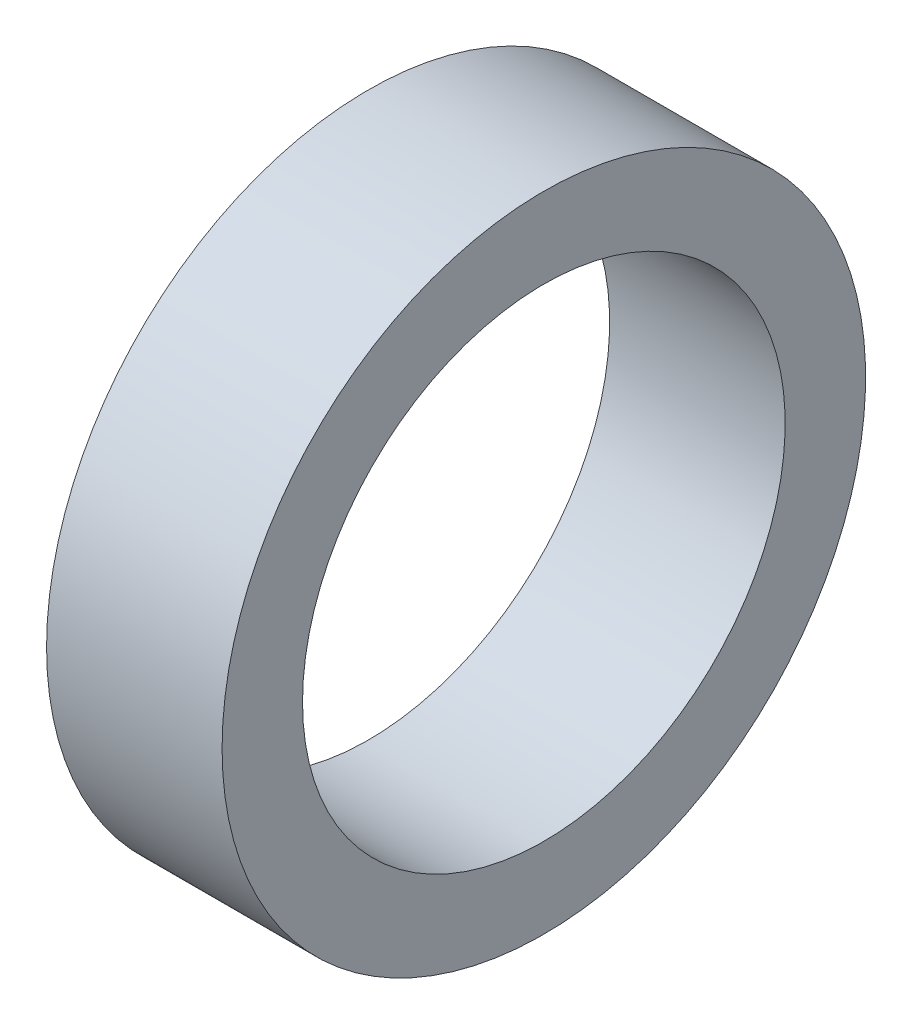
ISO-10303-21;
HEADER;
FILE_DESCRIPTION(('STEP AP214'),'2;1');
FILE_NAME('part.step','',(''),(''),'','','');
FILE_SCHEMA(('AUTOMOTIVE_DESIGN { 1 0 10303 214 1 1 1 1 }'));
ENDSEC;
DATA;
#1=APPLICATION_CONTEXT('core data for automotive mechanical design processes');
#2=APPLICATION_PROTOCOL_DEFINITION('international standard','automotive_design',2000,#1);
#3=PRODUCT_CONTEXT('',#1,'mechanical');
#4=PRODUCT('Part','Part','',(#3));
#5=PRODUCT_RELATED_PRODUCT_CATEGORY('part','',(#4));
#6=PRODUCT_DEFINITION_FORMATION('','',#4);
#7=PRODUCT_DEFINITION_CONTEXT('part definition',#1,'design');
#8=PRODUCT_DEFINITION('design','',#6,#7);
#9=PRODUCT_DEFINITION_SHAPE('','',#8);
#10=(LENGTH_UNIT() NAMED_UNIT(*) SI_UNIT(.MILLI.,.METRE.));
#11=(NAMED_UNIT(*) PLANE_ANGLE_UNIT() SI_UNIT($,.RADIAN.));
#12=(NAMED_UNIT(*) SI_UNIT($,.STERADIAN.) SOLID_ANGLE_UNIT());
#13=UNCERTAINTY_MEASURE_WITH_UNIT(LENGTH_MEASURE(1.E-05),#10,'distance_accuracy_value','');
#14=(GEOMETRIC_REPRESENTATION_CONTEXT(3) GLOBAL_UNCERTAINTY_ASSIGNED_CONTEXT((#13)) GLOBAL_UNIT_ASSIGNED_CONTEXT((#10,
#11,#12)) REPRESENTATION_CONTEXT('',''));
#15=CARTESIAN_POINT('',(0.,0.,0.));
#16=DIRECTION('',(0.,0.,1.));
#17=DIRECTION('',(1.,0.,0.));
#18=AXIS2_PLACEMENT_3D('',#15,#16,#17);
#19=CARTESIAN_POINT('',(-5.25971707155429,0.,0.));
#20=DIRECTION('',(-1.,0.,0.));
#21=DIRECTION('',(0.,0.,1.));
#22=AXIS2_PLACEMENT_3D('',#19,#20,#21);
#23=CYLINDRICAL_SURFACE('',#22,8.25);
#24=CARTESIAN_POINT('',(6.,0.,0.));
#25=DIRECTION('',(-1.,0.,0.));
#26=DIRECTION('',(0.,0.,1.));
#27=AXIS2_PLACEMENT_3D('',#24,#25,#26);
#28=CIRCLE('',#27,8.25);
#29=CARTESIAN_POINT('',(6.,0.,8.25));
#30=VERTEX_POINT('',#29);
#31=EDGE_CURVE('E17',#30,#30,#28,.F.);
#32=ORIENTED_EDGE('',*,*,#31,.T.);
#33=EDGE_LOOP('',(#32));
#34=FACE_BOUND('',#33,.T.);
#35=CARTESIAN_POINT('',(0.,0.,0.));
#36=DIRECTION('',(-1.,0.,0.));
#37=DIRECTION('',(0.,0.,1.));
#38=AXIS2_PLACEMENT_3D('',#35,#36,#37);
#39=CIRCLE('',#38,8.25);
#40=CARTESIAN_POINT('',(0.,0.,8.25));
#41=VERTEX_POINT('',#40);
#42=EDGE_CURVE('E26',#41,#41,#39,.T.);
#43=ORIENTED_EDGE('',*,*,#42,.T.);
#44=EDGE_LOOP('',(#43));
#45=FACE_BOUND('',#44,.T.);
#46=ADVANCED_FACE('F14',(#34,#45),#23,.F.);
#47=CARTESIAN_POINT('',(6.,11.,0.));
#48=DIRECTION('',(-1.,0.,0.));
#49=DIRECTION('',(0.,0.,1.));
#50=AXIS2_PLACEMENT_3D('',#47,#48,#49);
#51=PLANE('',#50);
#52=ORIENTED_EDGE('',*,*,#31,.F.);
#53=EDGE_LOOP('',(#52));
#54=FACE_BOUND('',#53,.T.);
#55=CARTESIAN_POINT('',(6.,0.,0.));
#56=DIRECTION('',(-1.,0.,0.));
#57=DIRECTION('',(0.,0.,1.));
#58=AXIS2_PLACEMENT_3D('',#55,#56,#57);
#59=CIRCLE('',#58,11.);
#60=CARTESIAN_POINT('',(6.,0.,11.));
#61=VERTEX_POINT('',#60);
#62=EDGE_CURVE('E21',#61,#61,#59,.T.);
#63=ORIENTED_EDGE('',*,*,#62,.F.);
#64=EDGE_LOOP('',(#63));
#65=FACE_BOUND('',#64,.T.);
#66=ADVANCED_FACE('F35',(#54,#65),#51,.F.);
#67=CARTESIAN_POINT('',(0.,11.,0.));
#68=DIRECTION('',(1.,0.,0.));
#69=DIRECTION('',(0.,0.,-1.));
#70=AXIS2_PLACEMENT_3D('',#67,#68,#69);
#71=PLANE('',#70);
#72=CARTESIAN_POINT('',(0.,0.,0.));
#73=DIRECTION('',(-1.,0.,0.));
#74=DIRECTION('',(0.,0.,1.));
#75=AXIS2_PLACEMENT_3D('',#72,#73,#74);
#76=CIRCLE('',#75,11.);
#77=CARTESIAN_POINT('',(0.,0.,11.));
#78=VERTEX_POINT('',#77);
#79=EDGE_CURVE('E10',#78,#78,#76,.F.);
#80=ORIENTED_EDGE('',*,*,#79,.F.);
#81=EDGE_LOOP('',(#80));
#82=FACE_BOUND('',#81,.T.);
#83=ORIENTED_EDGE('',*,*,#42,.F.);
#84=EDGE_LOOP('',(#83));
#85=FACE_BOUND('',#84,.T.);
#86=ADVANCED_FACE('F38',(#82,#85),#71,.F.);
#87=CARTESIAN_POINT('',(-5.25971707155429,0.,0.));
#88=DIRECTION('',(-1.,0.,0.));
#89=DIRECTION('',(0.,0.,1.));
#90=AXIS2_PLACEMENT_3D('',#87,#88,#89);
#91=CYLINDRICAL_SURFACE('',#90,11.);
#92=ORIENTED_EDGE('',*,*,#79,.T.);
#93=EDGE_LOOP('',(#92));
#94=FACE_BOUND('',#93,.T.);
#95=ORIENTED_EDGE('',*,*,#62,.T.);
#96=EDGE_LOOP('',(#95));
#97=FACE_BOUND('',#96,.T.);
#98=ADVANCED_FACE('F41',(#94,#97),#91,.T.);
#99=CLOSED_SHELL('',(#46,#66,#86,#98));
#100=MANIFOLD_SOLID_BREP('B1',#99);
#101=ADVANCED_BREP_SHAPE_REPRESENTATION('',(#18,#100),#14);
#102=SHAPE_DEFINITION_REPRESENTATION(#9,#101);
ENDSEC;
END-ISO-10303-21;
